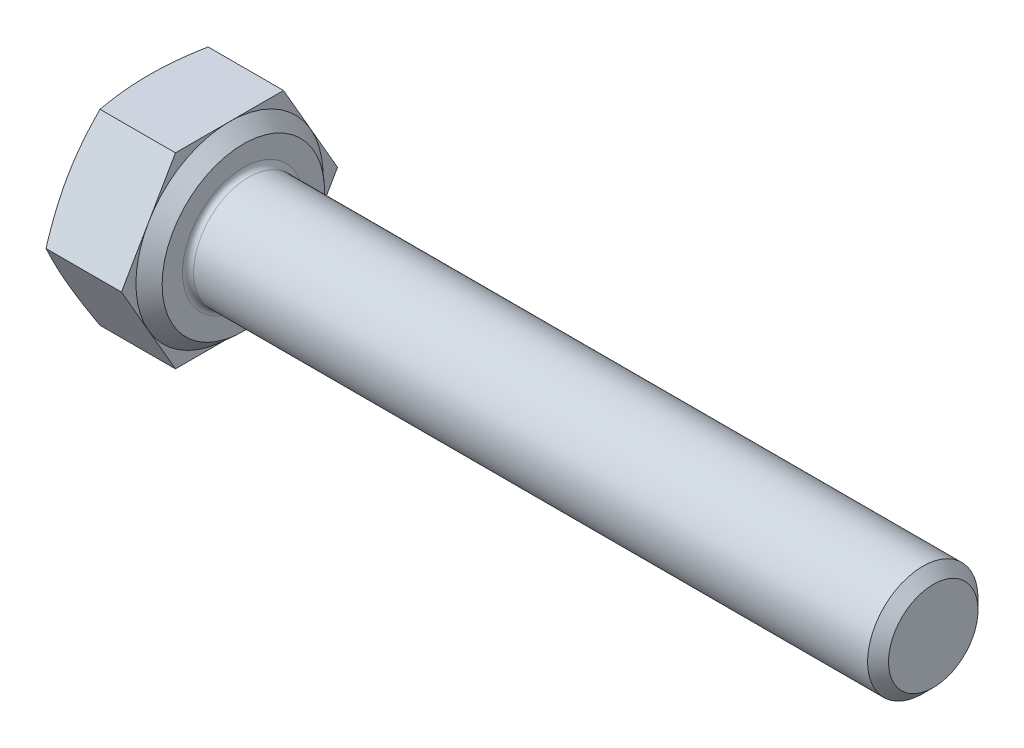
from build123d import *

# Parameters (mm, degrees)
BASEHEAD_DEPTH = 2.925
SKETCH3_R      = 2
BASEBODY_DEPTH = 25
HEADFILLET_R   = 0.2
CHAMFER1_SIZE  = 0.379


with BuildPart() as part:
    # Sketch-BaseHead → BaseHead (new body)
    with BuildSketch(Plane(origin=(0, 0, 0), x_dir=(0, 0, -1), z_dir=(1, 0, 0))):
        Polygon((3.914434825, 0), (1.957217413, 3.39), (-1.957217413, 3.39), (-3.914434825, 0), (-1.957217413, -3.39), (1.957217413, -3.39), align=None)
    extrude(amount=BASEHEAD_DEPTH)

    # Sketch4 → HeadChamfer (revolve, cut)
    with BuildSketch(Plane(origin=(-0.264637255, 0, 5.916896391), x_dir=(0, 0, -1), z_dir=(0, 1, 0))):
        Polygon((9.831331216, -0.264637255), (9.306896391, -0.264637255), (9.831331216, -0.455515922), align=None)
    revolve(axis=Axis((-4.001564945, 0, 0), (1, 0, 0)), mode=Mode.SUBTRACT)

    # Sketch1 → Revolve1 (revolve)
    with BuildSketch(Plane.XY, mode=Mode.PRIVATE) as revolve1_sk:
        Polygon((2.925, 0), (3.425, 0), (3.425, -2.94), (2.925, -3.39), align=None)
    revolve(revolve1_sk.sketch.rotate(Axis((-4.001564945, 0, 0), (1, 0, 0)), 270), axis=Axis((-4.001564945, 0, 0), (1, 0, 0)))

    # Sketch3 → BaseBody (add)
    with BuildSketch(Plane(origin=(3.425, 0, 0), x_dir=(0, 0, -1), z_dir=(1, 0, 0))):
        Circle(SKETCH3_R)
    extrude(amount=BASEBODY_DEPTH)

    # HeadFillet
    headfillet_edges = [part.edges().sort_by_distance(p)[0] for p in [
        (3.425, 0, 2),
    ]]
    fillet(headfillet_edges, radius=HEADFILLET_R)

    # Chamfer1
    chamfer1_edges = [part.edges().sort_by_distance(p)[0] for p in [
        (28.425, 0, 2),
    ]]
    chamfer(chamfer1_edges, length=CHAMFER1_SIZE)


solid = part.part
